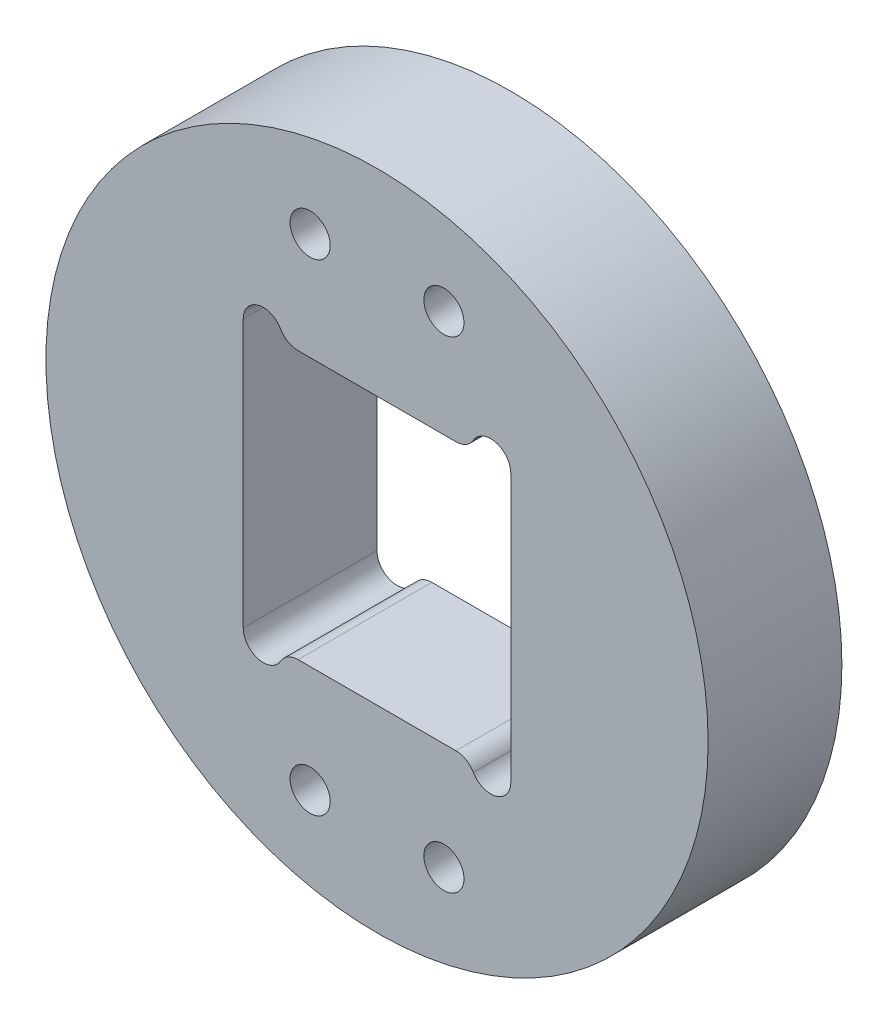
from build123d import *

# Parameters (mm, degrees)
ESQUISSE1_R        = 24.75
ESQUISSE1_R_2      = 1.5
BOSS_EXTRU_1_DEPTH = 10
CHANFREIN1_SIZE    = 2.2


with BuildPart() as part:
    # Esquisse1 → Boss.-Extru.1 (new body)
    with BuildSketch(Plane.XY):
        Circle(ESQUISSE1_R)
        with Locations((-5, 18)):
            Circle(ESQUISSE1_R_2, mode=Mode.SUBTRACT)
        with Locations((5, 18)):
            Circle(ESQUISSE1_R_2, mode=Mode.SUBTRACT)
        with Locations(Location((5, -18, 0), (0, 0, 180))):
            Circle(ESQUISSE1_R_2, mode=Mode.SUBTRACT)
        with Locations(Location((-5, -18, 0), (0, 0, 180))):
            Circle(ESQUISSE1_R_2, mode=Mode.SUBTRACT)
        with BuildLine():
            Line((-5.901923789, 10), (5.901923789, 10))
            ThreePointArc((5.901923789, 10), (6.651923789, 10.200961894), (7.200961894, 10.75))
            ThreePointArc((7.200961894, 10.75), (8.888228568, 11.448888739), (10, 10))
            Line((10, 10), (10, -10))
            ThreePointArc((10, -10), (8.888228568, -11.448888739), (7.200961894, -10.75))
            ThreePointArc((7.200961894, -10.75), (6.651923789, -10.200961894), (5.901923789, -10))
            Line((5.901923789, -10), (-5.901923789, -10))
            ThreePointArc((-5.901923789, -10), (-6.651923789, -10.200961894), (-7.200961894, -10.75))
            ThreePointArc((-7.200961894, -10.75), (-8.888228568, -11.448888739), (-10, -10))
            Line((-10, -10), (-10, 10))
            ThreePointArc((-10, 10), (-8.888228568, 11.448888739), (-7.200961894, 10.75))
            ThreePointArc((-7.200961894, 10.75), (-6.651923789, 10.200961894), (-5.901923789, 10))
        make_face(mode=Mode.SUBTRACT)
    extrude(amount=BOSS_EXTRU_1_DEPTH)

    # Chanfrein1
    chanfrein1_edges = [part.edges().sort_by_distance(p)[0] for p in [
        (3.5, 18, 0),
        (6.5, -18, 0),
        (-6.5, 18, 0),
        (-3.5, -18, 0),
    ]]
    chamfer(chanfrein1_edges, length=CHANFREIN1_SIZE)


solid = part.part
